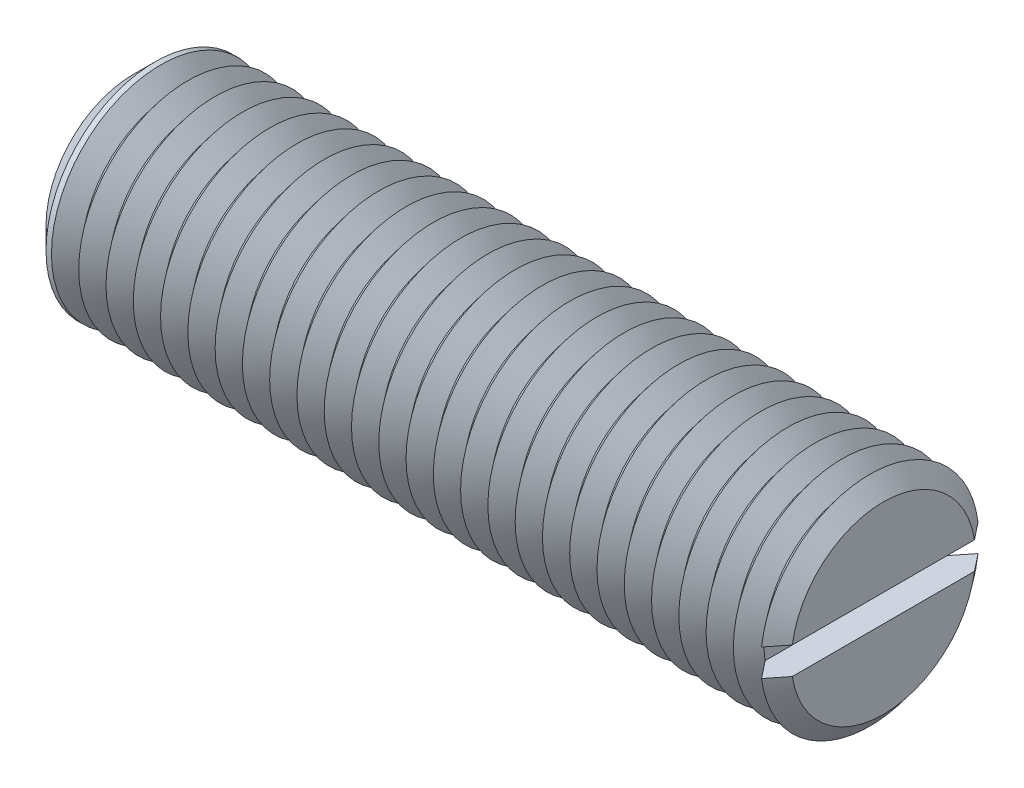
from build123d import *

# Parameters (mm, degrees)
SKETCH1_R       = 8
EXTRUDE1_DEPTH  = 27.5
SKETCH2_W       = 2
SKETCH2_H       = 2
EXTRUDE2_DEPTH  = 12
CHAMFER1_SIZE   = 1.6
LPATTERN1_COUNT = 27
LPATTERN1_PITCH = 2


with BuildPart() as part:
    # Sketch1 → Extrude1 (new, symmetric)
    with BuildSketch(Plane(origin=(0, 0, 0), x_dir=(0, 0, -1), z_dir=(1, 0, 0))):
        Circle(SKETCH1_R)
    extrude(amount=EXTRUDE1_DEPTH, both=True)

    # Sketch2 → Extrude2 (cut, symmetric)
    with BuildSketch(Plane.XY):
        with Locations((26.5, 0)):
            Rectangle(SKETCH2_W, SKETCH2_H)
    extrude(amount=EXTRUDE2_DEPTH, both=True, mode=Mode.SUBTRACT)

    # Chamfer1
    chamfer1_edges = [part.edges().sort_by_distance(p)[0] for p in [
        (-27.5, 0, 8),
    ]]
    chamfer(chamfer1_edges, length=CHAMFER1_SIZE)

    # Sketch3 → Cut-Revolve1 (revolve, cut)
    with BuildSketch(Plane.XY, mode=Mode.PRIVATE) as cut_revolve1_sk:
        Polygon((26.5, -8), (28.5, -8), (27.5, -6.7510004), align=None)
    cut_revolve1 = revolve(cut_revolve1_sk.sketch.rotate(Axis((0, 0, 0), (1, 0, 0)), 277.180755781), axis=Axis((0, 0, 0), (1, 0, 0)), mode=Mode.SUBTRACT)

    # LPattern1: Cut-Revolve1 ×27
    with Locations(*[(-i * LPATTERN1_PITCH, 0, 0) for i in range(1, LPATTERN1_COUNT)]):
        add(cut_revolve1, mode=Mode.SUBTRACT)


solid = part.part
